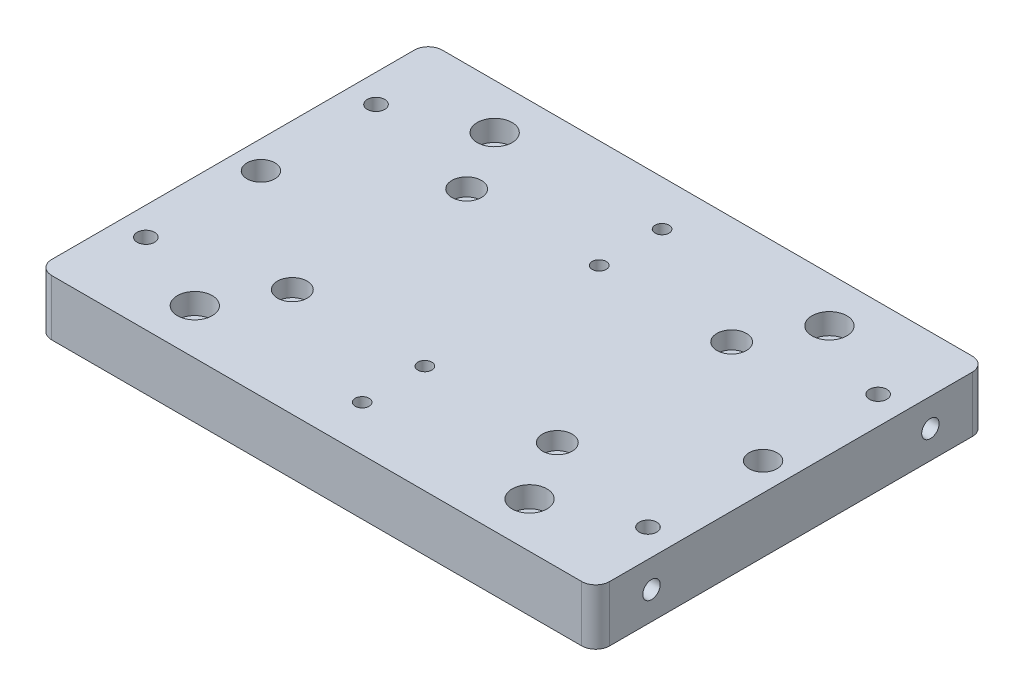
ISO-10303-21;
HEADER;
FILE_DESCRIPTION(('STEP AP214'),'2;1');
FILE_NAME('part.step','',(''),(''),'','','');
FILE_SCHEMA(('AUTOMOTIVE_DESIGN { 1 0 10303 214 1 1 1 1 }'));
ENDSEC;
DATA;
#1=APPLICATION_CONTEXT('core data for automotive mechanical design processes');
#2=APPLICATION_PROTOCOL_DEFINITION('international standard','automotive_design',2000,#1);
#3=PRODUCT_CONTEXT('',#1,'mechanical');
#4=PRODUCT('Part','Part','',(#3));
#5=PRODUCT_RELATED_PRODUCT_CATEGORY('part','',(#4));
#6=PRODUCT_DEFINITION_FORMATION('','',#4);
#7=PRODUCT_DEFINITION_CONTEXT('part definition',#1,'design');
#8=PRODUCT_DEFINITION('design','',#6,#7);
#9=PRODUCT_DEFINITION_SHAPE('','',#8);
#10=(LENGTH_UNIT() NAMED_UNIT(*) SI_UNIT(.MILLI.,.METRE.));
#11=(NAMED_UNIT(*) PLANE_ANGLE_UNIT() SI_UNIT($,.RADIAN.));
#12=(NAMED_UNIT(*) SI_UNIT($,.STERADIAN.) SOLID_ANGLE_UNIT());
#13=UNCERTAINTY_MEASURE_WITH_UNIT(LENGTH_MEASURE(1.E-05),#10,'distance_accuracy_value','');
#14=(GEOMETRIC_REPRESENTATION_CONTEXT(3) GLOBAL_UNCERTAINTY_ASSIGNED_CONTEXT((#13)) GLOBAL_UNIT_ASSIGNED_CONTEXT((#10,
#11,#12)) REPRESENTATION_CONTEXT('',''));
#15=CARTESIAN_POINT('',(0.,0.,0.));
#16=DIRECTION('',(0.,0.,1.));
#17=DIRECTION('',(1.,0.,0.));
#18=AXIS2_PLACEMENT_3D('',#15,#16,#17);
#19=CARTESIAN_POINT('',(0.,25.4,0.));
#20=DIRECTION('',(0.,1.,0.));
#21=DIRECTION('',(0.,0.,1.));
#22=AXIS2_PLACEMENT_3D('',#19,#20,#21);
#23=PLANE('',#22);
#24=CARTESIAN_POINT('',(7.43410938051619E-12,25.4,-68.3259999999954));
#25=DIRECTION('',(0.,-1.,0.));
#26=DIRECTION('',(0.,0.,-1.));
#27=AXIS2_PLACEMENT_3D('',#24,#25,#26);
#28=CIRCLE('',#27,3.17499999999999);
#29=CARTESIAN_POINT('',(7.43410938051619E-12,25.4,-71.5009999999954));
#30=VERTEX_POINT('',#29);
#31=EDGE_CURVE('E151',#30,#30,#28,.T.);
#32=ORIENTED_EDGE('',*,*,#31,.T.);
#33=EDGE_LOOP('',(#32));
#34=FACE_BOUND('',#33,.T.);
#35=DIRECTION('',(0.,0.,1.));
#36=VECTOR('',#35,1.);
#37=CARTESIAN_POINT('',(-127.,25.4,-88.9));
#38=LINE('',#37,#36);
#39=CARTESIAN_POINT('',(-127.,25.4,-82.55));
#40=VERTEX_POINT('',#39);
#41=CARTESIAN_POINT('',(-127.,25.4,82.55));
#42=VERTEX_POINT('',#41);
#43=EDGE_CURVE('E310',#40,#42,#38,.T.);
#44=ORIENTED_EDGE('',*,*,#43,.T.);
#45=CARTESIAN_POINT('',(-120.65,25.4,82.55));
#46=DIRECTION('',(0.,1.,0.));
#47=DIRECTION('',(0.,0.,1.));
#48=AXIS2_PLACEMENT_3D('',#45,#46,#47);
#49=CIRCLE('',#48,6.35);
#50=CARTESIAN_POINT('',(-120.65,25.4,88.9));
#51=VERTEX_POINT('',#50);
#52=EDGE_CURVE('E348',#42,#51,#49,.T.);
#53=ORIENTED_EDGE('',*,*,#52,.T.);
#54=DIRECTION('',(1.,0.,0.));
#55=VECTOR('',#54,1.);
#56=CARTESIAN_POINT('',(-127.,25.4,88.9));
#57=LINE('',#56,#55);
#58=CARTESIAN_POINT('',(120.65,25.4,88.9));
#59=VERTEX_POINT('',#58);
#60=EDGE_CURVE('E313',#51,#59,#57,.T.);
#61=ORIENTED_EDGE('',*,*,#60,.T.);
#62=CARTESIAN_POINT('',(120.65,25.4,82.55));
#63=DIRECTION('',(0.,1.,0.));
#64=DIRECTION('',(0.,0.,1.));
#65=AXIS2_PLACEMENT_3D('',#62,#63,#64);
#66=CIRCLE('',#65,6.35);
#67=CARTESIAN_POINT('',(127.,25.4,82.55));
#68=VERTEX_POINT('',#67);
#69=EDGE_CURVE('E343',#59,#68,#66,.T.);
#70=ORIENTED_EDGE('',*,*,#69,.T.);
#71=DIRECTION('',(0.,0.,-1.));
#72=VECTOR('',#71,1.);
#73=CARTESIAN_POINT('',(127.,25.4,-88.9));
#74=LINE('',#73,#72);
#75=CARTESIAN_POINT('',(127.,25.4,-82.55));
#76=VERTEX_POINT('',#75);
#77=EDGE_CURVE('E305',#68,#76,#74,.T.);
#78=ORIENTED_EDGE('',*,*,#77,.T.);
#79=CARTESIAN_POINT('',(120.65,25.4,-82.55));
#80=DIRECTION('',(0.,1.,0.));
#81=DIRECTION('',(0.,0.,1.));
#82=AXIS2_PLACEMENT_3D('',#79,#80,#81);
#83=CIRCLE('',#82,6.35);
#84=CARTESIAN_POINT('',(120.65,25.4,-88.9));
#85=VERTEX_POINT('',#84);
#86=EDGE_CURVE('E61',#76,#85,#83,.T.);
#87=ORIENTED_EDGE('',*,*,#86,.T.);
#88=DIRECTION('',(-1.,0.,0.));
#89=VECTOR('',#88,1.);
#90=CARTESIAN_POINT('',(-127.,25.4,-88.9));
#91=LINE('',#90,#89);
#92=CARTESIAN_POINT('',(-120.65,25.4,-88.9));
#93=VERTEX_POINT('',#92);
#94=EDGE_CURVE('E307',#85,#93,#91,.T.);
#95=ORIENTED_EDGE('',*,*,#94,.T.);
#96=CARTESIAN_POINT('',(-120.65,25.4,-82.55));
#97=DIRECTION('',(0.,1.,0.));
#98=DIRECTION('',(0.,0.,1.));
#99=AXIS2_PLACEMENT_3D('',#96,#97,#98);
#100=CIRCLE('',#99,6.35);
#101=EDGE_CURVE('E346',#93,#40,#100,.T.);
#102=ORIENTED_EDGE('',*,*,#101,.T.);
#103=EDGE_LOOP('',(#44,#53,#61,#70,#78,#87,#95,#102));
#104=FACE_BOUND('',#103,.T.);
#105=CARTESIAN_POINT('',(-60.325,25.4,39.6875));
#106=DIRECTION('',(0.,1.,0.));
#107=DIRECTION('',(0.,0.,1.));
#108=AXIS2_PLACEMENT_3D('',#105,#106,#107);
#109=CIRCLE('',#108,6.74751);
#110=CARTESIAN_POINT('',(-60.325,25.4,46.43501));
#111=VERTEX_POINT('',#110);
#112=EDGE_CURVE('E292',#111,#111,#109,.T.);
#113=ORIENTED_EDGE('',*,*,#112,.F.);
#114=EDGE_LOOP('',(#113));
#115=FACE_BOUND('',#114,.T.);
#116=CARTESIAN_POINT('',(60.325,25.4,39.6875));
#117=DIRECTION('',(0.,1.,0.));
#118=DIRECTION('',(0.,0.,1.));
#119=AXIS2_PLACEMENT_3D('',#116,#117,#118);
#120=CIRCLE('',#119,6.74751);
#121=CARTESIAN_POINT('',(60.325,25.4,46.43501));
#122=VERTEX_POINT('',#121);
#123=EDGE_CURVE('E280',#122,#122,#120,.T.);
#124=ORIENTED_EDGE('',*,*,#123,.F.);
#125=EDGE_LOOP('',(#124));
#126=FACE_BOUND('',#125,.T.);
#127=CARTESIAN_POINT('',(60.325,25.4,-39.6875));
#128=DIRECTION('',(0.,1.,0.));
#129=DIRECTION('',(0.,0.,1.));
#130=AXIS2_PLACEMENT_3D('',#127,#128,#129);
#131=CIRCLE('',#130,6.74751);
#132=CARTESIAN_POINT('',(60.325,25.4,-32.93999));
#133=VERTEX_POINT('',#132);
#134=EDGE_CURVE('E268',#133,#133,#131,.T.);
#135=ORIENTED_EDGE('',*,*,#134,.F.);
#136=EDGE_LOOP('',(#135));
#137=FACE_BOUND('',#136,.T.);
#138=CARTESIAN_POINT('',(-60.325,25.4,-39.6875));
#139=DIRECTION('',(0.,1.,0.));
#140=DIRECTION('',(0.,0.,1.));
#141=AXIS2_PLACEMENT_3D('',#138,#139,#140);
#142=CIRCLE('',#141,6.74751);
#143=CARTESIAN_POINT('',(-60.325,25.4,-32.93999));
#144=VERTEX_POINT('',#143);
#145=EDGE_CURVE('E256',#144,#144,#142,.T.);
#146=ORIENTED_EDGE('',*,*,#145,.F.);
#147=EDGE_LOOP('',(#146));
#148=FACE_BOUND('',#147,.T.);
#149=CARTESIAN_POINT('',(0.,25.4,-39.7002));
#150=DIRECTION('',(0.,1.,0.));
#151=DIRECTION('',(0.,0.,1.));
#152=AXIS2_PLACEMENT_3D('',#149,#150,#151);
#153=CIRCLE('',#152,3.175);
#154=CARTESIAN_POINT('',(0.,25.4,-36.5252));
#155=VERTEX_POINT('',#154);
#156=EDGE_CURVE('E250',#155,#155,#153,.T.);
#157=ORIENTED_EDGE('',*,*,#156,.F.);
#158=EDGE_LOOP('',(#157));
#159=FACE_BOUND('',#158,.T.);
#160=CARTESIAN_POINT('',(0.,25.4,39.6748));
#161=DIRECTION('',(0.,1.,0.));
#162=DIRECTION('',(0.,0.,1.));
#163=AXIS2_PLACEMENT_3D('',#160,#161,#162);
#164=CIRCLE('',#163,3.175);
#165=CARTESIAN_POINT('',(0.,25.4,42.8498));
#166=VERTEX_POINT('',#165);
#167=EDGE_CURVE('E244',#166,#166,#164,.T.);
#168=ORIENTED_EDGE('',*,*,#167,.F.);
#169=EDGE_LOOP('',(#168));
#170=FACE_BOUND('',#169,.T.);
#171=CARTESIAN_POINT('',(114.300000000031,25.4,-52.3875000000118));
#172=DIRECTION('',(0.,1.,0.));
#173=DIRECTION('',(0.,0.,1.));
#174=AXIS2_PLACEMENT_3D('',#171,#172,#173);
#175=CIRCLE('',#174,3.96874999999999);
#176=CARTESIAN_POINT('',(114.300000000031,25.4,-48.4187500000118));
#177=VERTEX_POINT('',#176);
#178=EDGE_CURVE('E238',#177,#177,#175,.T.);
#179=ORIENTED_EDGE('',*,*,#178,.F.);
#180=EDGE_LOOP('',(#179));
#181=FACE_BOUND('',#180,.T.);
#182=CARTESIAN_POINT('',(114.300000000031,25.4,52.387499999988));
#183=DIRECTION('',(0.,1.,0.));
#184=DIRECTION('',(0.,0.,1.));
#185=AXIS2_PLACEMENT_3D('',#182,#183,#184);
#186=CIRCLE('',#185,3.96874999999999);
#187=CARTESIAN_POINT('',(114.300000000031,25.4,56.356249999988));
#188=VERTEX_POINT('',#187);
#189=EDGE_CURVE('E232',#188,#188,#186,.T.);
#190=ORIENTED_EDGE('',*,*,#189,.F.);
#191=EDGE_LOOP('',(#190));
#192=FACE_BOUND('',#191,.T.);
#193=CARTESIAN_POINT('',(-114.299999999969,25.4,52.387499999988));
#194=DIRECTION('',(0.,1.,0.));
#195=DIRECTION('',(0.,0.,1.));
#196=AXIS2_PLACEMENT_3D('',#193,#194,#195);
#197=CIRCLE('',#196,3.96874999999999);
#198=CARTESIAN_POINT('',(-114.299999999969,25.4,56.356249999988));
#199=VERTEX_POINT('',#198);
#200=EDGE_CURVE('E226',#199,#199,#197,.T.);
#201=ORIENTED_EDGE('',*,*,#200,.F.);
#202=EDGE_LOOP('',(#201));
#203=FACE_BOUND('',#202,.T.);
#204=CARTESIAN_POINT('',(-114.299999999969,25.4,-52.3875000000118));
#205=DIRECTION('',(0.,1.,0.));
#206=DIRECTION('',(0.,0.,1.));
#207=AXIS2_PLACEMENT_3D('',#204,#205,#206);
#208=CIRCLE('',#207,3.96874999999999);
#209=CARTESIAN_POINT('',(-114.299999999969,25.4,-48.4187500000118));
#210=VERTEX_POINT('',#209);
#211=EDGE_CURVE('E220',#210,#210,#208,.T.);
#212=ORIENTED_EDGE('',*,*,#211,.F.);
#213=EDGE_LOOP('',(#212));
#214=FACE_BOUND('',#213,.T.);
#215=CARTESIAN_POINT('',(114.300000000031,25.4,-1.19904086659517E-11));
#216=DIRECTION('',(0.,1.,0.));
#217=DIRECTION('',(0.,0.,1.));
#218=AXIS2_PLACEMENT_3D('',#215,#216,#217);
#219=CIRCLE('',#218,6.34999999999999);
#220=CARTESIAN_POINT('',(114.300000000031,25.4,6.349999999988));
#221=VERTEX_POINT('',#220);
#222=EDGE_CURVE('E214',#221,#221,#219,.T.);
#223=ORIENTED_EDGE('',*,*,#222,.F.);
#224=EDGE_LOOP('',(#223));
#225=FACE_BOUND('',#224,.T.);
#226=CARTESIAN_POINT('',(-114.299999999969,25.4,-1.19904086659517E-11));
#227=DIRECTION('',(0.,1.,0.));
#228=DIRECTION('',(0.,0.,1.));
#229=AXIS2_PLACEMENT_3D('',#226,#227,#228);
#230=CIRCLE('',#229,6.34999999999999);
#231=CARTESIAN_POINT('',(-114.299999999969,25.4,6.349999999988));
#232=VERTEX_POINT('',#231);
#233=EDGE_CURVE('E208',#232,#232,#230,.T.);
#234=ORIENTED_EDGE('',*,*,#233,.F.);
#235=EDGE_LOOP('',(#234));
#236=FACE_BOUND('',#235,.T.);
#237=CARTESIAN_POINT('',(76.2000000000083,25.4,68.2117000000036));
#238=DIRECTION('',(0.,1.,0.));
#239=DIRECTION('',(0.,0.,1.));
#240=AXIS2_PLACEMENT_3D('',#237,#238,#239);
#241=CIRCLE('',#240,7.9375);
#242=CARTESIAN_POINT('',(76.2000000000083,25.4,76.1492000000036));
#243=VERTEX_POINT('',#242);
#244=EDGE_CURVE('E196',#243,#243,#241,.T.);
#245=ORIENTED_EDGE('',*,*,#244,.F.);
#246=EDGE_LOOP('',(#245));
#247=FACE_BOUND('',#246,.T.);
#248=CARTESIAN_POINT('',(-76.1999999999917,25.4,68.2117000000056));
#249=DIRECTION('',(0.,1.,0.));
#250=DIRECTION('',(0.,0.,1.));
#251=AXIS2_PLACEMENT_3D('',#248,#249,#250);
#252=CIRCLE('',#251,7.9375);
#253=CARTESIAN_POINT('',(-76.1999999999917,25.4,76.1492000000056));
#254=VERTEX_POINT('',#253);
#255=EDGE_CURVE('E184',#254,#254,#252,.T.);
#256=ORIENTED_EDGE('',*,*,#255,.F.);
#257=EDGE_LOOP('',(#256));
#258=FACE_BOUND('',#257,.T.);
#259=CARTESIAN_POINT('',(-76.1999999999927,25.4,-68.3132999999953));
#260=DIRECTION('',(0.,1.,0.));
#261=DIRECTION('',(0.,0.,1.));
#262=AXIS2_PLACEMENT_3D('',#259,#260,#261);
#263=CIRCLE('',#262,7.9375);
#264=CARTESIAN_POINT('',(-76.1999999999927,25.4,-60.3757999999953));
#265=VERTEX_POINT('',#264);
#266=EDGE_CURVE('E172',#265,#265,#263,.T.);
#267=ORIENTED_EDGE('',*,*,#266,.F.);
#268=EDGE_LOOP('',(#267));
#269=FACE_BOUND('',#268,.T.);
#270=CARTESIAN_POINT('',(76.2000000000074,25.4,-68.3132999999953));
#271=DIRECTION('',(0.,1.,0.));
#272=DIRECTION('',(0.,0.,1.));
#273=AXIS2_PLACEMENT_3D('',#270,#271,#272);
#274=CIRCLE('',#273,7.9375);
#275=CARTESIAN_POINT('',(76.2000000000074,25.4,-60.3757999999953));
#276=VERTEX_POINT('',#275);
#277=EDGE_CURVE('E160',#276,#276,#274,.T.);
#278=ORIENTED_EDGE('',*,*,#277,.F.);
#279=EDGE_LOOP('',(#278));
#280=FACE_BOUND('',#279,.T.);
#281=CARTESIAN_POINT('',(9.18141225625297E-12,25.4,68.1990000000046));
#282=DIRECTION('',(0.,-1.,0.));
#283=DIRECTION('',(0.,0.,-1.));
#284=AXIS2_PLACEMENT_3D('',#281,#282,#283);
#285=CIRCLE('',#284,3.17499999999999);
#286=CARTESIAN_POINT('',(9.18141225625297E-12,25.4,65.0240000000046));
#287=VERTEX_POINT('',#286);
#288=EDGE_CURVE('E157',#287,#287,#285,.T.);
#289=ORIENTED_EDGE('',*,*,#288,.T.);
#290=EDGE_LOOP('',(#289));
#291=FACE_BOUND('',#290,.T.);
#292=ADVANCED_FACE('F39',(#34,#104,#115,#126,#137,#148,#159,#170,#181,#192,#203,#214,#225,#236,
#247,#258,#269,#280,#291),#23,.T.);
#293=CARTESIAN_POINT('',(127.,25.4,-88.9));
#294=DIRECTION('',(-1.,0.,0.));
#295=DIRECTION('',(0.,0.,1.));
#296=AXIS2_PLACEMENT_3D('',#293,#294,#295);
#297=PLANE('',#296);
#298=CARTESIAN_POINT('',(127.,12.7,63.5));
#299=DIRECTION('',(1.,0.,0.));
#300=DIRECTION('',(0.,0.,-1.));
#301=AXIS2_PLACEMENT_3D('',#298,#299,#300);
#302=CIRCLE('',#301,3.96875);
#303=CARTESIAN_POINT('',(127.,12.7,59.53125));
#304=VERTEX_POINT('',#303);
#305=EDGE_CURVE('E126',#304,#304,#302,.T.);
#306=ORIENTED_EDGE('',*,*,#305,.F.);
#307=EDGE_LOOP('',(#306));
#308=FACE_BOUND('',#307,.T.);
#309=CARTESIAN_POINT('',(127.,12.7,-63.5));
#310=DIRECTION('',(1.,0.,0.));
#311=DIRECTION('',(0.,0.,-1.));
#312=AXIS2_PLACEMENT_3D('',#309,#310,#311);
#313=CIRCLE('',#312,3.96875);
#314=CARTESIAN_POINT('',(127.,12.7,-67.46875));
#315=VERTEX_POINT('',#314);
#316=EDGE_CURVE('E125',#315,#315,#313,.T.);
#317=ORIENTED_EDGE('',*,*,#316,.F.);
#318=EDGE_LOOP('',(#317));
#319=FACE_BOUND('',#318,.T.);
#320=DIRECTION('',(0.,0.,-1.));
#321=VECTOR('',#320,1.);
#322=CARTESIAN_POINT('',(127.,0.,-88.9));
#323=LINE('',#322,#321);
#324=CARTESIAN_POINT('',(127.,0.,82.55));
#325=VERTEX_POINT('',#324);
#326=CARTESIAN_POINT('',(127.,0.,-82.55));
#327=VERTEX_POINT('',#326);
#328=EDGE_CURVE('E304',#325,#327,#323,.T.);
#329=ORIENTED_EDGE('',*,*,#328,.T.);
#330=DIRECTION('',(0.,-1.,0.));
#331=VECTOR('',#330,1.);
#332=CARTESIAN_POINT('',(127.,25.4,-82.55));
#333=LINE('',#332,#331);
#334=EDGE_CURVE('E11',#327,#76,#333,.F.);
#335=ORIENTED_EDGE('',*,*,#334,.T.);
#336=ORIENTED_EDGE('',*,*,#77,.F.);
#337=DIRECTION('',(0.,-1.,0.));
#338=VECTOR('',#337,1.);
#339=CARTESIAN_POINT('',(127.,25.4,82.55));
#340=LINE('',#339,#338);
#341=EDGE_CURVE('E47',#68,#325,#340,.T.);
#342=ORIENTED_EDGE('',*,*,#341,.T.);
#343=EDGE_LOOP('',(#329,#335,#336,#342));
#344=FACE_BOUND('',#343,.T.);
#345=ADVANCED_FACE('F358',(#308,#319,#344),#297,.F.);
#346=CARTESIAN_POINT('',(-127.,25.4,-88.9));
#347=DIRECTION('',(0.,0.,1.));
#348=DIRECTION('',(1.,0.,0.));
#349=AXIS2_PLACEMENT_3D('',#346,#347,#348);
#350=PLANE('',#349);
#351=DIRECTION('',(-1.,0.,0.));
#352=VECTOR('',#351,1.);
#353=CARTESIAN_POINT('',(-127.,0.,-88.9));
#354=LINE('',#353,#352);
#355=CARTESIAN_POINT('',(120.65,0.,-88.9));
#356=VERTEX_POINT('',#355);
#357=CARTESIAN_POINT('',(-120.65,0.,-88.9));
#358=VERTEX_POINT('',#357);
#359=EDGE_CURVE('E319',#356,#358,#354,.T.);
#360=ORIENTED_EDGE('',*,*,#359,.T.);
#361=DIRECTION('',(0.,-1.,0.));
#362=VECTOR('',#361,1.);
#363=CARTESIAN_POINT('',(-120.65,25.4,-88.9));
#364=LINE('',#363,#362);
#365=EDGE_CURVE('E54',#358,#93,#364,.F.);
#366=ORIENTED_EDGE('',*,*,#365,.T.);
#367=ORIENTED_EDGE('',*,*,#94,.F.);
#368=DIRECTION('',(0.,-1.,0.));
#369=VECTOR('',#368,1.);
#370=CARTESIAN_POINT('',(120.65,25.4,-88.9));
#371=LINE('',#370,#369);
#372=EDGE_CURVE('E350',#85,#356,#371,.T.);
#373=ORIENTED_EDGE('',*,*,#372,.T.);
#374=EDGE_LOOP('',(#360,#366,#367,#373));
#375=FACE_BOUND('',#374,.T.);
#376=ADVANCED_FACE('F369',(#375),#350,.F.);
#377=CARTESIAN_POINT('',(-127.,25.4,-88.9));
#378=DIRECTION('',(1.,0.,0.));
#379=DIRECTION('',(0.,0.,-1.));
#380=AXIS2_PLACEMENT_3D('',#377,#378,#379);
#381=PLANE('',#380);
#382=CARTESIAN_POINT('',(-127.,12.7,63.5));
#383=DIRECTION('',(-1.,0.,0.));
#384=DIRECTION('',(0.,0.,1.));
#385=AXIS2_PLACEMENT_3D('',#382,#383,#384);
#386=CIRCLE('',#385,3.96875);
#387=CARTESIAN_POINT('',(-127.,12.7,67.46875));
#388=VERTEX_POINT('',#387);
#389=EDGE_CURVE('E136',#388,#388,#386,.T.);
#390=ORIENTED_EDGE('',*,*,#389,.F.);
#391=EDGE_LOOP('',(#390));
#392=FACE_BOUND('',#391,.T.);
#393=CARTESIAN_POINT('',(-127.,12.7,-63.5));
#394=DIRECTION('',(-1.,0.,0.));
#395=DIRECTION('',(0.,0.,1.));
#396=AXIS2_PLACEMENT_3D('',#393,#394,#395);
#397=CIRCLE('',#396,3.96875);
#398=CARTESIAN_POINT('',(-127.,12.7,-59.53125));
#399=VERTEX_POINT('',#398);
#400=EDGE_CURVE('E142',#399,#399,#397,.T.);
#401=ORIENTED_EDGE('',*,*,#400,.F.);
#402=EDGE_LOOP('',(#401));
#403=FACE_BOUND('',#402,.T.);
#404=DIRECTION('',(0.,0.,1.));
#405=VECTOR('',#404,1.);
#406=CARTESIAN_POINT('',(-127.,0.,-88.9));
#407=LINE('',#406,#405);
#408=CARTESIAN_POINT('',(-127.,0.,-82.55));
#409=VERTEX_POINT('',#408);
#410=CARTESIAN_POINT('',(-127.,0.,82.55));
#411=VERTEX_POINT('',#410);
#412=EDGE_CURVE('E321',#409,#411,#407,.T.);
#413=ORIENTED_EDGE('',*,*,#412,.T.);
#414=DIRECTION('',(0.,-1.,0.));
#415=VECTOR('',#414,1.);
#416=CARTESIAN_POINT('',(-127.,25.4,82.55));
#417=LINE('',#416,#415);
#418=EDGE_CURVE('E341',#411,#42,#417,.F.);
#419=ORIENTED_EDGE('',*,*,#418,.T.);
#420=ORIENTED_EDGE('',*,*,#43,.F.);
#421=DIRECTION('',(0.,-1.,0.));
#422=VECTOR('',#421,1.);
#423=CARTESIAN_POINT('',(-127.,25.4,-82.55));
#424=LINE('',#423,#422);
#425=EDGE_CURVE('E338',#40,#409,#424,.T.);
#426=ORIENTED_EDGE('',*,*,#425,.T.);
#427=EDGE_LOOP('',(#413,#419,#420,#426));
#428=FACE_BOUND('',#427,.T.);
#429=ADVANCED_FACE('F378',(#392,#403,#428),#381,.F.);
#430=CARTESIAN_POINT('',(-127.,25.4,88.9));
#431=DIRECTION('',(0.,0.,-1.));
#432=DIRECTION('',(-1.,0.,0.));
#433=AXIS2_PLACEMENT_3D('',#430,#431,#432);
#434=PLANE('',#433);
#435=ORIENTED_EDGE('',*,*,#60,.F.);
#436=DIRECTION('',(0.,-1.,0.));
#437=VECTOR('',#436,1.);
#438=CARTESIAN_POINT('',(-120.65,25.4,88.9));
#439=LINE('',#438,#437);
#440=CARTESIAN_POINT('',(-120.65,0.,88.9));
#441=VERTEX_POINT('',#440);
#442=EDGE_CURVE('E327',#51,#441,#439,.T.);
#443=ORIENTED_EDGE('',*,*,#442,.T.);
#444=DIRECTION('',(1.,0.,0.));
#445=VECTOR('',#444,1.);
#446=CARTESIAN_POINT('',(-127.,0.,88.9));
#447=LINE('',#446,#445);
#448=CARTESIAN_POINT('',(120.65,0.,88.9));
#449=VERTEX_POINT('',#448);
#450=EDGE_CURVE('E308',#441,#449,#447,.T.);
#451=ORIENTED_EDGE('',*,*,#450,.T.);
#452=DIRECTION('',(0.,-1.,0.));
#453=VECTOR('',#452,1.);
#454=CARTESIAN_POINT('',(120.65,25.4,88.9));
#455=LINE('',#454,#453);
#456=EDGE_CURVE('E316',#449,#59,#455,.F.);
#457=ORIENTED_EDGE('',*,*,#456,.T.);
#458=EDGE_LOOP('',(#435,#443,#451,#457));
#459=FACE_BOUND('',#458,.T.);
#460=ADVANCED_FACE('F386',(#459),#434,.F.);
#461=CARTESIAN_POINT('',(0.,0.,0.));
#462=DIRECTION('',(0.,1.,0.));
#463=DIRECTION('',(0.,0.,1.));
#464=AXIS2_PLACEMENT_3D('',#461,#462,#463);
#465=PLANE('',#464);
#466=CARTESIAN_POINT('',(7.43410938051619E-12,0.,-68.3259999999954));
#467=DIRECTION('',(0.,-1.,0.));
#468=DIRECTION('',(0.,0.,-1.));
#469=AXIS2_PLACEMENT_3D('',#466,#467,#468);
#470=CIRCLE('',#469,3.175);
#471=CARTESIAN_POINT('',(7.43410938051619E-12,0.,-71.5009999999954));
#472=VERTEX_POINT('',#471);
#473=EDGE_CURVE('E148',#472,#472,#470,.T.);
#474=ORIENTED_EDGE('',*,*,#473,.F.);
#475=EDGE_LOOP('',(#474));
#476=FACE_BOUND('',#475,.T.);
#477=CARTESIAN_POINT('',(9.18141225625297E-12,0.,68.1990000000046));
#478=DIRECTION('',(0.,-1.,0.));
#479=DIRECTION('',(0.,0.,-1.));
#480=AXIS2_PLACEMENT_3D('',#477,#478,#479);
#481=CIRCLE('',#480,3.175);
#482=CARTESIAN_POINT('',(9.18141225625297E-12,0.,65.0240000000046));
#483=VERTEX_POINT('',#482);
#484=EDGE_CURVE('E154',#483,#483,#481,.T.);
#485=ORIENTED_EDGE('',*,*,#484,.F.);
#486=EDGE_LOOP('',(#485));
#487=FACE_BOUND('',#486,.T.);
#488=CARTESIAN_POINT('',(76.2000000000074,0.,-68.3132999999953));
#489=DIRECTION('',(0.,1.,0.));
#490=DIRECTION('',(0.,0.,1.));
#491=AXIS2_PLACEMENT_3D('',#488,#489,#490);
#492=CIRCLE('',#491,5.04189999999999);
#493=CARTESIAN_POINT('',(76.2000000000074,0.,-63.2713999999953));
#494=VERTEX_POINT('',#493);
#495=EDGE_CURVE('E169',#494,#494,#492,.T.);
#496=ORIENTED_EDGE('',*,*,#495,.T.);
#497=EDGE_LOOP('',(#496));
#498=FACE_BOUND('',#497,.T.);
#499=CARTESIAN_POINT('',(-76.1999999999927,0.,-68.3132999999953));
#500=DIRECTION('',(0.,1.,0.));
#501=DIRECTION('',(0.,0.,1.));
#502=AXIS2_PLACEMENT_3D('',#499,#500,#501);
#503=CIRCLE('',#502,5.04189999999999);
#504=CARTESIAN_POINT('',(-76.1999999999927,0.,-63.2713999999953));
#505=VERTEX_POINT('',#504);
#506=EDGE_CURVE('E181',#505,#505,#503,.T.);
#507=ORIENTED_EDGE('',*,*,#506,.T.);
#508=EDGE_LOOP('',(#507));
#509=FACE_BOUND('',#508,.T.);
#510=CARTESIAN_POINT('',(-76.1999999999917,0.,68.2117000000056));
#511=DIRECTION('',(0.,1.,0.));
#512=DIRECTION('',(0.,0.,1.));
#513=AXIS2_PLACEMENT_3D('',#510,#511,#512);
#514=CIRCLE('',#513,5.04189999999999);
#515=CARTESIAN_POINT('',(-76.1999999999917,0.,73.2536000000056));
#516=VERTEX_POINT('',#515);
#517=EDGE_CURVE('E193',#516,#516,#514,.T.);
#518=ORIENTED_EDGE('',*,*,#517,.T.);
#519=EDGE_LOOP('',(#518));
#520=FACE_BOUND('',#519,.T.);
#521=CARTESIAN_POINT('',(76.2000000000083,0.,68.2117000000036));
#522=DIRECTION('',(0.,1.,0.));
#523=DIRECTION('',(0.,0.,1.));
#524=AXIS2_PLACEMENT_3D('',#521,#522,#523);
#525=CIRCLE('',#524,5.04189999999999);
#526=CARTESIAN_POINT('',(76.2000000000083,0.,73.2536000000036));
#527=VERTEX_POINT('',#526);
#528=EDGE_CURVE('E205',#527,#527,#525,.T.);
#529=ORIENTED_EDGE('',*,*,#528,.T.);
#530=EDGE_LOOP('',(#529));
#531=FACE_BOUND('',#530,.T.);
#532=CARTESIAN_POINT('',(-114.299999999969,0.,-1.19904086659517E-11));
#533=DIRECTION('',(0.,1.,0.));
#534=DIRECTION('',(0.,0.,1.));
#535=AXIS2_PLACEMENT_3D('',#532,#533,#534);
#536=CIRCLE('',#535,6.34999999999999);
#537=CARTESIAN_POINT('',(-114.299999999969,0.,6.349999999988));
#538=VERTEX_POINT('',#537);
#539=EDGE_CURVE('E211',#538,#538,#536,.T.);
#540=ORIENTED_EDGE('',*,*,#539,.T.);
#541=EDGE_LOOP('',(#540));
#542=FACE_BOUND('',#541,.T.);
#543=CARTESIAN_POINT('',(114.300000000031,0.,-1.19904086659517E-11));
#544=DIRECTION('',(0.,1.,0.));
#545=DIRECTION('',(0.,0.,1.));
#546=AXIS2_PLACEMENT_3D('',#543,#544,#545);
#547=CIRCLE('',#546,6.34999999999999);
#548=CARTESIAN_POINT('',(114.300000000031,0.,6.349999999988));
#549=VERTEX_POINT('',#548);
#550=EDGE_CURVE('E217',#549,#549,#547,.T.);
#551=ORIENTED_EDGE('',*,*,#550,.T.);
#552=EDGE_LOOP('',(#551));
#553=FACE_BOUND('',#552,.T.);
#554=CARTESIAN_POINT('',(-114.299999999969,0.,-52.3875000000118));
#555=DIRECTION('',(0.,1.,0.));
#556=DIRECTION('',(0.,0.,1.));
#557=AXIS2_PLACEMENT_3D('',#554,#555,#556);
#558=CIRCLE('',#557,3.96874999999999);
#559=CARTESIAN_POINT('',(-114.299999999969,0.,-48.4187500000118));
#560=VERTEX_POINT('',#559);
#561=EDGE_CURVE('E223',#560,#560,#558,.T.);
#562=ORIENTED_EDGE('',*,*,#561,.T.);
#563=EDGE_LOOP('',(#562));
#564=FACE_BOUND('',#563,.T.);
#565=CARTESIAN_POINT('',(-114.299999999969,0.,52.387499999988));
#566=DIRECTION('',(0.,1.,0.));
#567=DIRECTION('',(0.,0.,1.));
#568=AXIS2_PLACEMENT_3D('',#565,#566,#567);
#569=CIRCLE('',#568,3.96874999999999);
#570=CARTESIAN_POINT('',(-114.299999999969,0.,56.356249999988));
#571=VERTEX_POINT('',#570);
#572=EDGE_CURVE('E229',#571,#571,#569,.T.);
#573=ORIENTED_EDGE('',*,*,#572,.T.);
#574=EDGE_LOOP('',(#573));
#575=FACE_BOUND('',#574,.T.);
#576=CARTESIAN_POINT('',(114.300000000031,0.,52.387499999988));
#577=DIRECTION('',(0.,1.,0.));
#578=DIRECTION('',(0.,0.,1.));
#579=AXIS2_PLACEMENT_3D('',#576,#577,#578);
#580=CIRCLE('',#579,3.96874999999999);
#581=CARTESIAN_POINT('',(114.300000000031,0.,56.356249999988));
#582=VERTEX_POINT('',#581);
#583=EDGE_CURVE('E235',#582,#582,#580,.T.);
#584=ORIENTED_EDGE('',*,*,#583,.T.);
#585=EDGE_LOOP('',(#584));
#586=FACE_BOUND('',#585,.T.);
#587=CARTESIAN_POINT('',(114.300000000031,0.,-52.3875000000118));
#588=DIRECTION('',(0.,1.,0.));
#589=DIRECTION('',(0.,0.,1.));
#590=AXIS2_PLACEMENT_3D('',#587,#588,#589);
#591=CIRCLE('',#590,3.96874999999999);
#592=CARTESIAN_POINT('',(114.300000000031,0.,-48.4187500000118));
#593=VERTEX_POINT('',#592);
#594=EDGE_CURVE('E241',#593,#593,#591,.T.);
#595=ORIENTED_EDGE('',*,*,#594,.T.);
#596=EDGE_LOOP('',(#595));
#597=FACE_BOUND('',#596,.T.);
#598=CARTESIAN_POINT('',(0.,0.,39.6748));
#599=DIRECTION('',(0.,1.,0.));
#600=DIRECTION('',(0.,0.,1.));
#601=AXIS2_PLACEMENT_3D('',#598,#599,#600);
#602=CIRCLE('',#601,3.17499999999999);
#603=CARTESIAN_POINT('',(0.,0.,42.8498));
#604=VERTEX_POINT('',#603);
#605=EDGE_CURVE('E247',#604,#604,#602,.T.);
#606=ORIENTED_EDGE('',*,*,#605,.T.);
#607=EDGE_LOOP('',(#606));
#608=FACE_BOUND('',#607,.T.);
#609=CARTESIAN_POINT('',(0.,0.,-39.7002));
#610=DIRECTION('',(0.,1.,0.));
#611=DIRECTION('',(0.,0.,1.));
#612=AXIS2_PLACEMENT_3D('',#609,#610,#611);
#613=CIRCLE('',#612,3.17499999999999);
#614=CARTESIAN_POINT('',(0.,0.,-36.5252));
#615=VERTEX_POINT('',#614);
#616=EDGE_CURVE('E253',#615,#615,#613,.T.);
#617=ORIENTED_EDGE('',*,*,#616,.T.);
#618=EDGE_LOOP('',(#617));
#619=FACE_BOUND('',#618,.T.);
#620=CARTESIAN_POINT('',(-60.325,0.,-39.6875));
#621=DIRECTION('',(0.,1.,0.));
#622=DIRECTION('',(0.,0.,1.));
#623=AXIS2_PLACEMENT_3D('',#620,#621,#622);
#624=CIRCLE('',#623,4.21639999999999);
#625=CARTESIAN_POINT('',(-60.325,0.,-35.4711));
#626=VERTEX_POINT('',#625);
#627=EDGE_CURVE('E265',#626,#626,#624,.T.);
#628=ORIENTED_EDGE('',*,*,#627,.T.);
#629=EDGE_LOOP('',(#628));
#630=FACE_BOUND('',#629,.T.);
#631=CARTESIAN_POINT('',(60.325,0.,-39.6875));
#632=DIRECTION('',(0.,1.,0.));
#633=DIRECTION('',(0.,0.,1.));
#634=AXIS2_PLACEMENT_3D('',#631,#632,#633);
#635=CIRCLE('',#634,4.21639999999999);
#636=CARTESIAN_POINT('',(60.325,0.,-35.4711));
#637=VERTEX_POINT('',#636);
#638=EDGE_CURVE('E277',#637,#637,#635,.T.);
#639=ORIENTED_EDGE('',*,*,#638,.T.);
#640=EDGE_LOOP('',(#639));
#641=FACE_BOUND('',#640,.T.);
#642=CARTESIAN_POINT('',(60.325,0.,39.6875));
#643=DIRECTION('',(0.,1.,0.));
#644=DIRECTION('',(0.,0.,1.));
#645=AXIS2_PLACEMENT_3D('',#642,#643,#644);
#646=CIRCLE('',#645,4.21639999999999);
#647=CARTESIAN_POINT('',(60.325,0.,43.9039));
#648=VERTEX_POINT('',#647);
#649=EDGE_CURVE('E289',#648,#648,#646,.T.);
#650=ORIENTED_EDGE('',*,*,#649,.T.);
#651=EDGE_LOOP('',(#650));
#652=FACE_BOUND('',#651,.T.);
#653=CARTESIAN_POINT('',(-60.325,0.,39.6875));
#654=DIRECTION('',(0.,1.,0.));
#655=DIRECTION('',(0.,0.,1.));
#656=AXIS2_PLACEMENT_3D('',#653,#654,#655);
#657=CIRCLE('',#656,4.21639999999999);
#658=CARTESIAN_POINT('',(-60.325,0.,43.9039));
#659=VERTEX_POINT('',#658);
#660=EDGE_CURVE('E301',#659,#659,#657,.T.);
#661=ORIENTED_EDGE('',*,*,#660,.T.);
#662=EDGE_LOOP('',(#661));
#663=FACE_BOUND('',#662,.T.);
#664=ORIENTED_EDGE('',*,*,#450,.F.);
#665=CARTESIAN_POINT('',(-120.65,0.,82.55));
#666=DIRECTION('',(0.,1.,0.));
#667=DIRECTION('',(0.,0.,1.));
#668=AXIS2_PLACEMENT_3D('',#665,#666,#667);
#669=CIRCLE('',#668,6.35);
#670=EDGE_CURVE('E336',#441,#411,#669,.F.);
#671=ORIENTED_EDGE('',*,*,#670,.T.);
#672=ORIENTED_EDGE('',*,*,#412,.F.);
#673=CARTESIAN_POINT('',(-120.65,0.,-82.55));
#674=DIRECTION('',(0.,1.,0.));
#675=DIRECTION('',(0.,0.,1.));
#676=AXIS2_PLACEMENT_3D('',#673,#674,#675);
#677=CIRCLE('',#676,6.35);
#678=EDGE_CURVE('E334',#409,#358,#677,.F.);
#679=ORIENTED_EDGE('',*,*,#678,.T.);
#680=ORIENTED_EDGE('',*,*,#359,.F.);
#681=CARTESIAN_POINT('',(120.65,0.,-82.55));
#682=DIRECTION('',(0.,1.,0.));
#683=DIRECTION('',(0.,0.,1.));
#684=AXIS2_PLACEMENT_3D('',#681,#682,#683);
#685=CIRCLE('',#684,6.35);
#686=EDGE_CURVE('E332',#356,#327,#685,.F.);
#687=ORIENTED_EDGE('',*,*,#686,.T.);
#688=ORIENTED_EDGE('',*,*,#328,.F.);
#689=CARTESIAN_POINT('',(120.65,0.,82.55));
#690=DIRECTION('',(0.,1.,0.));
#691=DIRECTION('',(0.,0.,1.));
#692=AXIS2_PLACEMENT_3D('',#689,#690,#691);
#693=CIRCLE('',#692,6.35);
#694=EDGE_CURVE('E330',#325,#449,#693,.F.);
#695=ORIENTED_EDGE('',*,*,#694,.T.);
#696=EDGE_LOOP('',(#664,#671,#672,#679,#680,#687,#688,#695));
#697=FACE_BOUND('',#696,.T.);
#698=ADVANCED_FACE('F364',(#476,#487,#498,#509,#520,#531,#542,#553,#564,#575,#586,#597,#608,
#619,#630,#641,#652,#663,#697),#465,.F.);
#699=CARTESIAN_POINT('',(-60.325,25.4,39.6875));
#700=DIRECTION('',(0.,1.,0.));
#701=DIRECTION('',(0.,0.,1.));
#702=AXIS2_PLACEMENT_3D('',#699,#700,#701);
#703=CYLINDRICAL_SURFACE('',#702,4.2164);
#704=ORIENTED_EDGE('',*,*,#660,.F.);
#705=EDGE_LOOP('',(#704));
#706=FACE_BOUND('',#705,.T.);
#707=CARTESIAN_POINT('',(-60.325,17.4625,39.6875));
#708=DIRECTION('',(0.,1.,0.));
#709=DIRECTION('',(0.,0.,1.));
#710=AXIS2_PLACEMENT_3D('',#707,#708,#709);
#711=CIRCLE('',#710,4.2164);
#712=CARTESIAN_POINT('',(-60.325,17.4625,43.9039));
#713=VERTEX_POINT('',#712);
#714=EDGE_CURVE('E298',#713,#713,#711,.T.);
#715=ORIENTED_EDGE('',*,*,#714,.T.);
#716=EDGE_LOOP('',(#715));
#717=FACE_BOUND('',#716,.T.);
#718=ADVANCED_FACE('F406',(#706,#717),#703,.F.);
#719=CARTESIAN_POINT('',(-56.1086,17.4625,39.6875));
#720=DIRECTION('',(0.,-1.,0.));
#721=DIRECTION('',(0.,0.,-1.));
#722=AXIS2_PLACEMENT_3D('',#719,#720,#721);
#723=PLANE('',#722);
#724=ORIENTED_EDGE('',*,*,#714,.F.);
#725=EDGE_LOOP('',(#724));
#726=FACE_BOUND('',#725,.T.);
#727=CARTESIAN_POINT('',(-60.325,17.4625,39.6875));
#728=DIRECTION('',(0.,1.,0.));
#729=DIRECTION('',(0.,0.,1.));
#730=AXIS2_PLACEMENT_3D('',#727,#728,#729);
#731=CIRCLE('',#730,6.74751);
#732=CARTESIAN_POINT('',(-60.325,17.4625,46.43501));
#733=VERTEX_POINT('',#732);
#734=EDGE_CURVE('E295',#733,#733,#731,.T.);
#735=ORIENTED_EDGE('',*,*,#734,.T.);
#736=EDGE_LOOP('',(#735));
#737=FACE_BOUND('',#736,.T.);
#738=ADVANCED_FACE('F873',(#726,#737),#723,.F.);
#739=CARTESIAN_POINT('',(-60.325,25.4,39.6875));
#740=DIRECTION('',(0.,1.,0.));
#741=DIRECTION('',(0.,0.,1.));
#742=AXIS2_PLACEMENT_3D('',#739,#740,#741);
#743=CYLINDRICAL_SURFACE('',#742,6.74751);
#744=ORIENTED_EDGE('',*,*,#734,.F.);
#745=EDGE_LOOP('',(#744));
#746=FACE_BOUND('',#745,.T.);
#747=ORIENTED_EDGE('',*,*,#112,.T.);
#748=EDGE_LOOP('',(#747));
#749=FACE_BOUND('',#748,.T.);
#750=ADVANCED_FACE('F864',(#746,#749),#743,.F.);
#751=CARTESIAN_POINT('',(60.325,25.4,39.6875));
#752=DIRECTION('',(0.,1.,0.));
#753=DIRECTION('',(0.,0.,1.));
#754=AXIS2_PLACEMENT_3D('',#751,#752,#753);
#755=CYLINDRICAL_SURFACE('',#754,4.21639999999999);
#756=ORIENTED_EDGE('',*,*,#649,.F.);
#757=EDGE_LOOP('',(#756));
#758=FACE_BOUND('',#757,.T.);
#759=CARTESIAN_POINT('',(60.325,17.4625,39.6875));
#760=DIRECTION('',(0.,1.,0.));
#761=DIRECTION('',(0.,0.,1.));
#762=AXIS2_PLACEMENT_3D('',#759,#760,#761);
#763=CIRCLE('',#762,4.21639999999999);
#764=CARTESIAN_POINT('',(60.325,17.4625,43.9039));
#765=VERTEX_POINT('',#764);
#766=EDGE_CURVE('E286',#765,#765,#763,.T.);
#767=ORIENTED_EDGE('',*,*,#766,.T.);
#768=EDGE_LOOP('',(#767));
#769=FACE_BOUND('',#768,.T.);
#770=ADVANCED_FACE('F855',(#758,#769),#755,.F.);
#771=CARTESIAN_POINT('',(64.5414,17.4625,39.6875));
#772=DIRECTION('',(0.,-1.,0.));
#773=DIRECTION('',(0.,0.,-1.));
#774=AXIS2_PLACEMENT_3D('',#771,#772,#773);
#775=PLANE('',#774);
#776=ORIENTED_EDGE('',*,*,#766,.F.);
#777=EDGE_LOOP('',(#776));
#778=FACE_BOUND('',#777,.T.);
#779=CARTESIAN_POINT('',(60.325,17.4625,39.6875));
#780=DIRECTION('',(0.,1.,0.));
#781=DIRECTION('',(0.,0.,1.));
#782=AXIS2_PLACEMENT_3D('',#779,#780,#781);
#783=CIRCLE('',#782,6.74751);
#784=CARTESIAN_POINT('',(60.325,17.4625,46.43501));
#785=VERTEX_POINT('',#784);
#786=EDGE_CURVE('E283',#785,#785,#783,.T.);
#787=ORIENTED_EDGE('',*,*,#786,.T.);
#788=EDGE_LOOP('',(#787));
#789=FACE_BOUND('',#788,.T.);
#790=ADVANCED_FACE('F846',(#778,#789),#775,.F.);
#791=CARTESIAN_POINT('',(60.325,25.4,39.6875));
#792=DIRECTION('',(0.,1.,0.));
#793=DIRECTION('',(0.,0.,1.));
#794=AXIS2_PLACEMENT_3D('',#791,#792,#793);
#795=CYLINDRICAL_SURFACE('',#794,6.74751);
#796=ORIENTED_EDGE('',*,*,#786,.F.);
#797=EDGE_LOOP('',(#796));
#798=FACE_BOUND('',#797,.T.);
#799=ORIENTED_EDGE('',*,*,#123,.T.);
#800=EDGE_LOOP('',(#799));
#801=FACE_BOUND('',#800,.T.);
#802=ADVANCED_FACE('F837',(#798,#801),#795,.F.);
#803=CARTESIAN_POINT('',(60.325,25.4,-39.6875));
#804=DIRECTION('',(0.,1.,0.));
#805=DIRECTION('',(0.,0.,1.));
#806=AXIS2_PLACEMENT_3D('',#803,#804,#805);
#807=CYLINDRICAL_SURFACE('',#806,4.21639999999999);
#808=ORIENTED_EDGE('',*,*,#638,.F.);
#809=EDGE_LOOP('',(#808));
#810=FACE_BOUND('',#809,.T.);
#811=CARTESIAN_POINT('',(60.325,17.4625,-39.6875));
#812=DIRECTION('',(0.,1.,0.));
#813=DIRECTION('',(0.,0.,1.));
#814=AXIS2_PLACEMENT_3D('',#811,#812,#813);
#815=CIRCLE('',#814,4.21639999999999);
#816=CARTESIAN_POINT('',(60.325,17.4625,-35.4711));
#817=VERTEX_POINT('',#816);
#818=EDGE_CURVE('E274',#817,#817,#815,.T.);
#819=ORIENTED_EDGE('',*,*,#818,.T.);
#820=EDGE_LOOP('',(#819));
#821=FACE_BOUND('',#820,.T.);
#822=ADVANCED_FACE('F828',(#810,#821),#807,.F.);
#823=CARTESIAN_POINT('',(64.5414,17.4625,-39.6875));
#824=DIRECTION('',(0.,-1.,0.));
#825=DIRECTION('',(0.,0.,-1.));
#826=AXIS2_PLACEMENT_3D('',#823,#824,#825);
#827=PLANE('',#826);
#828=ORIENTED_EDGE('',*,*,#818,.F.);
#829=EDGE_LOOP('',(#828));
#830=FACE_BOUND('',#829,.T.);
#831=CARTESIAN_POINT('',(60.325,17.4625,-39.6875));
#832=DIRECTION('',(0.,1.,0.));
#833=DIRECTION('',(0.,0.,1.));
#834=AXIS2_PLACEMENT_3D('',#831,#832,#833);
#835=CIRCLE('',#834,6.74751);
#836=CARTESIAN_POINT('',(60.325,17.4625,-32.93999));
#837=VERTEX_POINT('',#836);
#838=EDGE_CURVE('E271',#837,#837,#835,.T.);
#839=ORIENTED_EDGE('',*,*,#838,.T.);
#840=EDGE_LOOP('',(#839));
#841=FACE_BOUND('',#840,.T.);
#842=ADVANCED_FACE('F819',(#830,#841),#827,.F.);
#843=CARTESIAN_POINT('',(60.325,25.4,-39.6875));
#844=DIRECTION('',(0.,1.,0.));
#845=DIRECTION('',(0.,0.,1.));
#846=AXIS2_PLACEMENT_3D('',#843,#844,#845);
#847=CYLINDRICAL_SURFACE('',#846,6.74751);
#848=ORIENTED_EDGE('',*,*,#838,.F.);
#849=EDGE_LOOP('',(#848));
#850=FACE_BOUND('',#849,.T.);
#851=ORIENTED_EDGE('',*,*,#134,.T.);
#852=EDGE_LOOP('',(#851));
#853=FACE_BOUND('',#852,.T.);
#854=ADVANCED_FACE('F810',(#850,#853),#847,.F.);
#855=CARTESIAN_POINT('',(-60.325,25.4,-39.6875));
#856=DIRECTION('',(0.,1.,0.));
#857=DIRECTION('',(0.,0.,1.));
#858=AXIS2_PLACEMENT_3D('',#855,#856,#857);
#859=CYLINDRICAL_SURFACE('',#858,4.2164);
#860=ORIENTED_EDGE('',*,*,#627,.F.);
#861=EDGE_LOOP('',(#860));
#862=FACE_BOUND('',#861,.T.);
#863=CARTESIAN_POINT('',(-60.325,17.4625,-39.6875));
#864=DIRECTION('',(0.,1.,0.));
#865=DIRECTION('',(0.,0.,1.));
#866=AXIS2_PLACEMENT_3D('',#863,#864,#865);
#867=CIRCLE('',#866,4.2164);
#868=CARTESIAN_POINT('',(-60.325,17.4625,-35.4711));
#869=VERTEX_POINT('',#868);
#870=EDGE_CURVE('E262',#869,#869,#867,.T.);
#871=ORIENTED_EDGE('',*,*,#870,.T.);
#872=EDGE_LOOP('',(#871));
#873=FACE_BOUND('',#872,.T.);
#874=ADVANCED_FACE('F801',(#862,#873),#859,.F.);
#875=CARTESIAN_POINT('',(-56.1086,17.4625,-39.6875));
#876=DIRECTION('',(0.,-1.,0.));
#877=DIRECTION('',(0.,0.,-1.));
#878=AXIS2_PLACEMENT_3D('',#875,#876,#877);
#879=PLANE('',#878);
#880=ORIENTED_EDGE('',*,*,#870,.F.);
#881=EDGE_LOOP('',(#880));
#882=FACE_BOUND('',#881,.T.);
#883=CARTESIAN_POINT('',(-60.325,17.4625,-39.6875));
#884=DIRECTION('',(0.,1.,0.));
#885=DIRECTION('',(0.,0.,1.));
#886=AXIS2_PLACEMENT_3D('',#883,#884,#885);
#887=CIRCLE('',#886,6.74751);
#888=CARTESIAN_POINT('',(-60.325,17.4625,-32.93999));
#889=VERTEX_POINT('',#888);
#890=EDGE_CURVE('E259',#889,#889,#887,.T.);
#891=ORIENTED_EDGE('',*,*,#890,.T.);
#892=EDGE_LOOP('',(#891));
#893=FACE_BOUND('',#892,.T.);
#894=ADVANCED_FACE('F792',(#882,#893),#879,.F.);
#895=CARTESIAN_POINT('',(-60.325,25.4,-39.6875));
#896=DIRECTION('',(0.,1.,0.));
#897=DIRECTION('',(0.,0.,1.));
#898=AXIS2_PLACEMENT_3D('',#895,#896,#897);
#899=CYLINDRICAL_SURFACE('',#898,6.74751);
#900=ORIENTED_EDGE('',*,*,#890,.F.);
#901=EDGE_LOOP('',(#900));
#902=FACE_BOUND('',#901,.T.);
#903=ORIENTED_EDGE('',*,*,#145,.T.);
#904=EDGE_LOOP('',(#903));
#905=FACE_BOUND('',#904,.T.);
#906=ADVANCED_FACE('F783',(#902,#905),#899,.F.);
#907=CARTESIAN_POINT('',(0.,25.4,-39.7002));
#908=DIRECTION('',(0.,1.,0.));
#909=DIRECTION('',(0.,0.,1.));
#910=AXIS2_PLACEMENT_3D('',#907,#908,#909);
#911=CYLINDRICAL_SURFACE('',#910,3.175);
#912=ORIENTED_EDGE('',*,*,#616,.F.);
#913=EDGE_LOOP('',(#912));
#914=FACE_BOUND('',#913,.T.);
#915=ORIENTED_EDGE('',*,*,#156,.T.);
#916=EDGE_LOOP('',(#915));
#917=FACE_BOUND('',#916,.T.);
#918=ADVANCED_FACE('F774',(#914,#917),#911,.F.);
#919=CARTESIAN_POINT('',(0.,25.4,39.6748));
#920=DIRECTION('',(0.,1.,0.));
#921=DIRECTION('',(0.,0.,1.));
#922=AXIS2_PLACEMENT_3D('',#919,#920,#921);
#923=CYLINDRICAL_SURFACE('',#922,3.175);
#924=ORIENTED_EDGE('',*,*,#605,.F.);
#925=EDGE_LOOP('',(#924));
#926=FACE_BOUND('',#925,.T.);
#927=ORIENTED_EDGE('',*,*,#167,.T.);
#928=EDGE_LOOP('',(#927));
#929=FACE_BOUND('',#928,.T.);
#930=ADVANCED_FACE('F509',(#926,#929),#923,.F.);
#931=CARTESIAN_POINT('',(114.300000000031,25.4,-52.3875000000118));
#932=DIRECTION('',(0.,1.,0.));
#933=DIRECTION('',(0.,0.,1.));
#934=AXIS2_PLACEMENT_3D('',#931,#932,#933);
#935=CYLINDRICAL_SURFACE('',#934,3.96874999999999);
#936=ORIENTED_EDGE('',*,*,#594,.F.);
#937=EDGE_LOOP('',(#936));
#938=FACE_BOUND('',#937,.T.);
#939=ORIENTED_EDGE('',*,*,#178,.T.);
#940=EDGE_LOOP('',(#939));
#941=FACE_BOUND('',#940,.T.);
#942=ADVANCED_FACE('F503',(#938,#941),#935,.F.);
#943=CARTESIAN_POINT('',(114.300000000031,25.4,52.387499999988));
#944=DIRECTION('',(0.,1.,0.));
#945=DIRECTION('',(0.,0.,1.));
#946=AXIS2_PLACEMENT_3D('',#943,#944,#945);
#947=CYLINDRICAL_SURFACE('',#946,3.96874999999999);
#948=ORIENTED_EDGE('',*,*,#583,.F.);
#949=EDGE_LOOP('',(#948));
#950=FACE_BOUND('',#949,.T.);
#951=ORIENTED_EDGE('',*,*,#189,.T.);
#952=EDGE_LOOP('',(#951));
#953=FACE_BOUND('',#952,.T.);
#954=ADVANCED_FACE('F508',(#950,#953),#947,.F.);
#955=CARTESIAN_POINT('',(-114.299999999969,25.4,52.387499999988));
#956=DIRECTION('',(0.,1.,0.));
#957=DIRECTION('',(0.,0.,1.));
#958=AXIS2_PLACEMENT_3D('',#955,#956,#957);
#959=CYLINDRICAL_SURFACE('',#958,3.96874999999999);
#960=ORIENTED_EDGE('',*,*,#572,.F.);
#961=EDGE_LOOP('',(#960));
#962=FACE_BOUND('',#961,.T.);
#963=ORIENTED_EDGE('',*,*,#200,.T.);
#964=EDGE_LOOP('',(#963));
#965=FACE_BOUND('',#964,.T.);
#966=ADVANCED_FACE('F521',(#962,#965),#959,.F.);
#967=CARTESIAN_POINT('',(-114.299999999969,25.4,-52.3875000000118));
#968=DIRECTION('',(0.,1.,0.));
#969=DIRECTION('',(0.,0.,1.));
#970=AXIS2_PLACEMENT_3D('',#967,#968,#969);
#971=CYLINDRICAL_SURFACE('',#970,3.96874999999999);
#972=ORIENTED_EDGE('',*,*,#561,.F.);
#973=EDGE_LOOP('',(#972));
#974=FACE_BOUND('',#973,.T.);
#975=ORIENTED_EDGE('',*,*,#211,.T.);
#976=EDGE_LOOP('',(#975));
#977=FACE_BOUND('',#976,.T.);
#978=ADVANCED_FACE('F531',(#974,#977),#971,.F.);
#979=CARTESIAN_POINT('',(114.300000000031,25.4,-1.19904086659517E-11));
#980=DIRECTION('',(0.,1.,0.));
#981=DIRECTION('',(0.,0.,1.));
#982=AXIS2_PLACEMENT_3D('',#979,#980,#981);
#983=CYLINDRICAL_SURFACE('',#982,6.34999999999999);
#984=ORIENTED_EDGE('',*,*,#550,.F.);
#985=EDGE_LOOP('',(#984));
#986=FACE_BOUND('',#985,.T.);
#987=ORIENTED_EDGE('',*,*,#222,.T.);
#988=EDGE_LOOP('',(#987));
#989=FACE_BOUND('',#988,.T.);
#990=ADVANCED_FACE('F540',(#986,#989),#983,.F.);
#991=CARTESIAN_POINT('',(-114.299999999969,25.4,-1.19904086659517E-11));
#992=DIRECTION('',(0.,1.,0.));
#993=DIRECTION('',(0.,0.,1.));
#994=AXIS2_PLACEMENT_3D('',#991,#992,#993);
#995=CYLINDRICAL_SURFACE('',#994,6.34999999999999);
#996=ORIENTED_EDGE('',*,*,#539,.F.);
#997=EDGE_LOOP('',(#996));
#998=FACE_BOUND('',#997,.T.);
#999=ORIENTED_EDGE('',*,*,#233,.T.);
#1000=EDGE_LOOP('',(#999));
#1001=FACE_BOUND('',#1000,.T.);
#1002=ADVANCED_FACE('F550',(#998,#1001),#995,.F.);
#1003=CARTESIAN_POINT('',(76.2000000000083,25.4,68.2117000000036));
#1004=DIRECTION('',(0.,1.,0.));
#1005=DIRECTION('',(0.,0.,1.));
#1006=AXIS2_PLACEMENT_3D('',#1003,#1004,#1005);
#1007=CYLINDRICAL_SURFACE('',#1006,5.04189999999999);
#1008=ORIENTED_EDGE('',*,*,#528,.F.);
#1009=EDGE_LOOP('',(#1008));
#1010=FACE_BOUND('',#1009,.T.);
#1011=CARTESIAN_POINT('',(76.2000000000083,15.875,68.2117000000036));
#1012=DIRECTION('',(0.,1.,0.));
#1013=DIRECTION('',(0.,0.,1.));
#1014=AXIS2_PLACEMENT_3D('',#1011,#1012,#1013);
#1015=CIRCLE('',#1014,5.0419);
#1016=CARTESIAN_POINT('',(76.2000000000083,15.875,73.2536000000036));
#1017=VERTEX_POINT('',#1016);
#1018=EDGE_CURVE('E202',#1017,#1017,#1015,.T.);
#1019=ORIENTED_EDGE('',*,*,#1018,.T.);
#1020=EDGE_LOOP('',(#1019));
#1021=FACE_BOUND('',#1020,.T.);
#1022=ADVANCED_FACE('F558',(#1010,#1021),#1007,.F.);
#1023=CARTESIAN_POINT('',(81.2419000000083,15.875,68.2117000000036));
#1024=DIRECTION('',(0.,-1.,0.));
#1025=DIRECTION('',(0.,0.,-1.));
#1026=AXIS2_PLACEMENT_3D('',#1023,#1024,#1025);
#1027=PLANE('',#1026);
#1028=ORIENTED_EDGE('',*,*,#1018,.F.);
#1029=EDGE_LOOP('',(#1028));
#1030=FACE_BOUND('',#1029,.T.);
#1031=CARTESIAN_POINT('',(76.2000000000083,15.875,68.2117000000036));
#1032=DIRECTION('',(0.,1.,0.));
#1033=DIRECTION('',(0.,0.,1.));
#1034=AXIS2_PLACEMENT_3D('',#1031,#1032,#1033);
#1035=CIRCLE('',#1034,7.9375);
#1036=CARTESIAN_POINT('',(76.2000000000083,15.875,76.1492000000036));
#1037=VERTEX_POINT('',#1036);
#1038=EDGE_CURVE('E199',#1037,#1037,#1035,.T.);
#1039=ORIENTED_EDGE('',*,*,#1038,.T.);
#1040=EDGE_LOOP('',(#1039));
#1041=FACE_BOUND('',#1040,.T.);
#1042=ADVANCED_FACE('F566',(#1030,#1041),#1027,.F.);
#1043=CARTESIAN_POINT('',(76.2000000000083,25.4,68.2117000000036));
#1044=DIRECTION('',(0.,1.,0.));
#1045=DIRECTION('',(0.,0.,1.));
#1046=AXIS2_PLACEMENT_3D('',#1043,#1044,#1045);
#1047=CYLINDRICAL_SURFACE('',#1046,7.9375);
#1048=ORIENTED_EDGE('',*,*,#1038,.F.);
#1049=EDGE_LOOP('',(#1048));
#1050=FACE_BOUND('',#1049,.T.);
#1051=ORIENTED_EDGE('',*,*,#244,.T.);
#1052=EDGE_LOOP('',(#1051));
#1053=FACE_BOUND('',#1052,.T.);
#1054=ADVANCED_FACE('F574',(#1050,#1053),#1047,.F.);
#1055=CARTESIAN_POINT('',(-76.1999999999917,25.4,68.2117000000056));
#1056=DIRECTION('',(0.,1.,0.));
#1057=DIRECTION('',(0.,0.,1.));
#1058=AXIS2_PLACEMENT_3D('',#1055,#1056,#1057);
#1059=CYLINDRICAL_SURFACE('',#1058,5.04189999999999);
#1060=ORIENTED_EDGE('',*,*,#517,.F.);
#1061=EDGE_LOOP('',(#1060));
#1062=FACE_BOUND('',#1061,.T.);
#1063=CARTESIAN_POINT('',(-76.1999999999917,15.875,68.2117000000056));
#1064=DIRECTION('',(0.,1.,0.));
#1065=DIRECTION('',(0.,0.,1.));
#1066=AXIS2_PLACEMENT_3D('',#1063,#1064,#1065);
#1067=CIRCLE('',#1066,5.0419);
#1068=CARTESIAN_POINT('',(-76.1999999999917,15.875,73.2536000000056));
#1069=VERTEX_POINT('',#1068);
#1070=EDGE_CURVE('E190',#1069,#1069,#1067,.T.);
#1071=ORIENTED_EDGE('',*,*,#1070,.T.);
#1072=EDGE_LOOP('',(#1071));
#1073=FACE_BOUND('',#1072,.T.);
#1074=ADVANCED_FACE('F582',(#1062,#1073),#1059,.F.);
#1075=CARTESIAN_POINT('',(-71.1580999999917,15.875,68.2117000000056));
#1076=DIRECTION('',(0.,-1.,0.));
#1077=DIRECTION('',(0.,0.,-1.));
#1078=AXIS2_PLACEMENT_3D('',#1075,#1076,#1077);
#1079=PLANE('',#1078);
#1080=ORIENTED_EDGE('',*,*,#1070,.F.);
#1081=EDGE_LOOP('',(#1080));
#1082=FACE_BOUND('',#1081,.T.);
#1083=CARTESIAN_POINT('',(-76.1999999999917,15.875,68.2117000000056));
#1084=DIRECTION('',(0.,1.,0.));
#1085=DIRECTION('',(0.,0.,1.));
#1086=AXIS2_PLACEMENT_3D('',#1083,#1084,#1085);
#1087=CIRCLE('',#1086,7.9375);
#1088=CARTESIAN_POINT('',(-76.1999999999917,15.875,76.1492000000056));
#1089=VERTEX_POINT('',#1088);
#1090=EDGE_CURVE('E187',#1089,#1089,#1087,.T.);
#1091=ORIENTED_EDGE('',*,*,#1090,.T.);
#1092=EDGE_LOOP('',(#1091));
#1093=FACE_BOUND('',#1092,.T.);
#1094=ADVANCED_FACE('F590',(#1082,#1093),#1079,.F.);
#1095=CARTESIAN_POINT('',(-76.1999999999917,25.4,68.2117000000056));
#1096=DIRECTION('',(0.,1.,0.));
#1097=DIRECTION('',(0.,0.,1.));
#1098=AXIS2_PLACEMENT_3D('',#1095,#1096,#1097);
#1099=CYLINDRICAL_SURFACE('',#1098,7.9375);
#1100=ORIENTED_EDGE('',*,*,#1090,.F.);
#1101=EDGE_LOOP('',(#1100));
#1102=FACE_BOUND('',#1101,.T.);
#1103=ORIENTED_EDGE('',*,*,#255,.T.);
#1104=EDGE_LOOP('',(#1103));
#1105=FACE_BOUND('',#1104,.T.);
#1106=ADVANCED_FACE('F598',(#1102,#1105),#1099,.F.);
#1107=CARTESIAN_POINT('',(-76.1999999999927,25.4,-68.3132999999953));
#1108=DIRECTION('',(0.,1.,0.));
#1109=DIRECTION('',(0.,0.,1.));
#1110=AXIS2_PLACEMENT_3D('',#1107,#1108,#1109);
#1111=CYLINDRICAL_SURFACE('',#1110,5.04189999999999);
#1112=ORIENTED_EDGE('',*,*,#506,.F.);
#1113=EDGE_LOOP('',(#1112));
#1114=FACE_BOUND('',#1113,.T.);
#1115=CARTESIAN_POINT('',(-76.1999999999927,15.875,-68.3132999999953));
#1116=DIRECTION('',(0.,1.,0.));
#1117=DIRECTION('',(0.,0.,1.));
#1118=AXIS2_PLACEMENT_3D('',#1115,#1116,#1117);
#1119=CIRCLE('',#1118,5.0419);
#1120=CARTESIAN_POINT('',(-76.1999999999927,15.875,-63.2713999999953));
#1121=VERTEX_POINT('',#1120);
#1122=EDGE_CURVE('E178',#1121,#1121,#1119,.T.);
#1123=ORIENTED_EDGE('',*,*,#1122,.T.);
#1124=EDGE_LOOP('',(#1123));
#1125=FACE_BOUND('',#1124,.T.);
#1126=ADVANCED_FACE('F606',(#1114,#1125),#1111,.F.);
#1127=CARTESIAN_POINT('',(-71.1580999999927,15.875,-68.3132999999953));
#1128=DIRECTION('',(0.,-1.,0.));
#1129=DIRECTION('',(0.,0.,-1.));
#1130=AXIS2_PLACEMENT_3D('',#1127,#1128,#1129);
#1131=PLANE('',#1130);
#1132=ORIENTED_EDGE('',*,*,#1122,.F.);
#1133=EDGE_LOOP('',(#1132));
#1134=FACE_BOUND('',#1133,.T.);
#1135=CARTESIAN_POINT('',(-76.1999999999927,15.875,-68.3132999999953));
#1136=DIRECTION('',(0.,1.,0.));
#1137=DIRECTION('',(0.,0.,1.));
#1138=AXIS2_PLACEMENT_3D('',#1135,#1136,#1137);
#1139=CIRCLE('',#1138,7.9375);
#1140=CARTESIAN_POINT('',(-76.1999999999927,15.875,-60.3757999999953));
#1141=VERTEX_POINT('',#1140);
#1142=EDGE_CURVE('E175',#1141,#1141,#1139,.T.);
#1143=ORIENTED_EDGE('',*,*,#1142,.T.);
#1144=EDGE_LOOP('',(#1143));
#1145=FACE_BOUND('',#1144,.T.);
#1146=ADVANCED_FACE('F614',(#1134,#1145),#1131,.F.);
#1147=CARTESIAN_POINT('',(-76.1999999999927,25.4,-68.3132999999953));
#1148=DIRECTION('',(0.,1.,0.));
#1149=DIRECTION('',(0.,0.,1.));
#1150=AXIS2_PLACEMENT_3D('',#1147,#1148,#1149);
#1151=CYLINDRICAL_SURFACE('',#1150,7.9375);
#1152=ORIENTED_EDGE('',*,*,#1142,.F.);
#1153=EDGE_LOOP('',(#1152));
#1154=FACE_BOUND('',#1153,.T.);
#1155=ORIENTED_EDGE('',*,*,#266,.T.);
#1156=EDGE_LOOP('',(#1155));
#1157=FACE_BOUND('',#1156,.T.);
#1158=ADVANCED_FACE('F622',(#1154,#1157),#1151,.F.);
#1159=CARTESIAN_POINT('',(76.2000000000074,25.4,-68.3132999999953));
#1160=DIRECTION('',(0.,1.,0.));
#1161=DIRECTION('',(0.,0.,1.));
#1162=AXIS2_PLACEMENT_3D('',#1159,#1160,#1161);
#1163=CYLINDRICAL_SURFACE('',#1162,5.04189999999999);
#1164=ORIENTED_EDGE('',*,*,#495,.F.);
#1165=EDGE_LOOP('',(#1164));
#1166=FACE_BOUND('',#1165,.T.);
#1167=CARTESIAN_POINT('',(76.2000000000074,15.875,-68.3132999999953));
#1168=DIRECTION('',(0.,1.,0.));
#1169=DIRECTION('',(0.,0.,1.));
#1170=AXIS2_PLACEMENT_3D('',#1167,#1168,#1169);
#1171=CIRCLE('',#1170,5.0419);
#1172=CARTESIAN_POINT('',(76.2000000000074,15.875,-63.2713999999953));
#1173=VERTEX_POINT('',#1172);
#1174=EDGE_CURVE('E166',#1173,#1173,#1171,.T.);
#1175=ORIENTED_EDGE('',*,*,#1174,.T.);
#1176=EDGE_LOOP('',(#1175));
#1177=FACE_BOUND('',#1176,.T.);
#1178=ADVANCED_FACE('F630',(#1166,#1177),#1163,.F.);
#1179=CARTESIAN_POINT('',(81.2419000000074,15.875,-68.3132999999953));
#1180=DIRECTION('',(0.,-1.,0.));
#1181=DIRECTION('',(0.,0.,-1.));
#1182=AXIS2_PLACEMENT_3D('',#1179,#1180,#1181);
#1183=PLANE('',#1182);
#1184=ORIENTED_EDGE('',*,*,#1174,.F.);
#1185=EDGE_LOOP('',(#1184));
#1186=FACE_BOUND('',#1185,.T.);
#1187=CARTESIAN_POINT('',(76.2000000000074,15.875,-68.3132999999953));
#1188=DIRECTION('',(0.,1.,0.));
#1189=DIRECTION('',(0.,0.,1.));
#1190=AXIS2_PLACEMENT_3D('',#1187,#1188,#1189);
#1191=CIRCLE('',#1190,7.9375);
#1192=CARTESIAN_POINT('',(76.2000000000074,15.875,-60.3757999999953));
#1193=VERTEX_POINT('',#1192);
#1194=EDGE_CURVE('E163',#1193,#1193,#1191,.T.);
#1195=ORIENTED_EDGE('',*,*,#1194,.T.);
#1196=EDGE_LOOP('',(#1195));
#1197=FACE_BOUND('',#1196,.T.);
#1198=ADVANCED_FACE('F638',(#1186,#1197),#1183,.F.);
#1199=CARTESIAN_POINT('',(76.2000000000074,25.4,-68.3132999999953));
#1200=DIRECTION('',(0.,1.,0.));
#1201=DIRECTION('',(0.,0.,1.));
#1202=AXIS2_PLACEMENT_3D('',#1199,#1200,#1201);
#1203=CYLINDRICAL_SURFACE('',#1202,7.9375);
#1204=ORIENTED_EDGE('',*,*,#1194,.F.);
#1205=EDGE_LOOP('',(#1204));
#1206=FACE_BOUND('',#1205,.T.);
#1207=ORIENTED_EDGE('',*,*,#277,.T.);
#1208=EDGE_LOOP('',(#1207));
#1209=FACE_BOUND('',#1208,.T.);
#1210=ADVANCED_FACE('F646',(#1206,#1209),#1203,.F.);
#1211=CARTESIAN_POINT('',(9.18141225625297E-12,0.,68.1990000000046));
#1212=DIRECTION('',(0.,-1.,0.));
#1213=DIRECTION('',(0.,0.,-1.));
#1214=AXIS2_PLACEMENT_3D('',#1211,#1212,#1213);
#1215=CYLINDRICAL_SURFACE('',#1214,3.175);
#1216=ORIENTED_EDGE('',*,*,#288,.F.);
#1217=EDGE_LOOP('',(#1216));
#1218=FACE_BOUND('',#1217,.T.);
#1219=ORIENTED_EDGE('',*,*,#484,.T.);
#1220=EDGE_LOOP('',(#1219));
#1221=FACE_BOUND('',#1220,.T.);
#1222=ADVANCED_FACE('F654',(#1218,#1221),#1215,.F.);
#1223=CARTESIAN_POINT('',(7.43410938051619E-12,0.,-68.3259999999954));
#1224=DIRECTION('',(0.,-1.,0.));
#1225=DIRECTION('',(0.,0.,-1.));
#1226=AXIS2_PLACEMENT_3D('',#1223,#1224,#1225);
#1227=CYLINDRICAL_SURFACE('',#1226,3.175);
#1228=ORIENTED_EDGE('',*,*,#31,.F.);
#1229=EDGE_LOOP('',(#1228));
#1230=FACE_BOUND('',#1229,.T.);
#1231=ORIENTED_EDGE('',*,*,#473,.T.);
#1232=EDGE_LOOP('',(#1231));
#1233=FACE_BOUND('',#1232,.T.);
#1234=ADVANCED_FACE('F662',(#1230,#1233),#1227,.F.);
#1235=CARTESIAN_POINT('',(-110.998,12.7,-63.5));
#1236=DIRECTION('',(-1.,0.,0.));
#1237=DIRECTION('',(0.,0.,1.));
#1238=AXIS2_PLACEMENT_3D('',#1235,#1236,#1237);
#1239=CONICAL_SURFACE('',#1238,3.96875,1.02974425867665);
#1240=CARTESIAN_POINT('',(-108.613334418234,12.7,-63.5));
#1241=VERTEX_POINT('',#1240);
#1242=VERTEX_LOOP('',#1241);
#1243=FACE_BOUND('',#1242,.T.);
#1244=CARTESIAN_POINT('',(-110.998,12.7,-63.5));
#1245=DIRECTION('',(-1.,0.,0.));
#1246=DIRECTION('',(0.,0.,1.));
#1247=AXIS2_PLACEMENT_3D('',#1244,#1245,#1246);
#1248=CIRCLE('',#1247,3.96875);
#1249=CARTESIAN_POINT('',(-110.998,12.7,-59.53125));
#1250=VERTEX_POINT('',#1249);
#1251=EDGE_CURVE('E145',#1250,#1250,#1248,.T.);
#1252=ORIENTED_EDGE('',*,*,#1251,.T.);
#1253=EDGE_LOOP('',(#1252));
#1254=FACE_BOUND('',#1253,.T.);
#1255=ADVANCED_FACE('F496',(#1243,#1254),#1239,.F.);
#1256=CARTESIAN_POINT('',(-127.,12.7,-63.5));
#1257=DIRECTION('',(-1.,0.,0.));
#1258=DIRECTION('',(0.,0.,1.));
#1259=AXIS2_PLACEMENT_3D('',#1256,#1257,#1258);
#1260=CYLINDRICAL_SURFACE('',#1259,3.96875);
#1261=ORIENTED_EDGE('',*,*,#1251,.F.);
#1262=EDGE_LOOP('',(#1261));
#1263=FACE_BOUND('',#1262,.T.);
#1264=ORIENTED_EDGE('',*,*,#400,.T.);
#1265=EDGE_LOOP('',(#1264));
#1266=FACE_BOUND('',#1265,.T.);
#1267=ADVANCED_FACE('F491',(#1263,#1266),#1260,.F.);
#1268=CARTESIAN_POINT('',(-110.998,12.7,63.5));
#1269=DIRECTION('',(-1.,0.,0.));
#1270=DIRECTION('',(0.,0.,1.));
#1271=AXIS2_PLACEMENT_3D('',#1268,#1269,#1270);
#1272=CONICAL_SURFACE('',#1271,3.96874999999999,1.02974425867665);
#1273=CARTESIAN_POINT('',(-108.613334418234,12.7,63.5));
#1274=VERTEX_POINT('',#1273);
#1275=VERTEX_LOOP('',#1274);
#1276=FACE_BOUND('',#1275,.T.);
#1277=CARTESIAN_POINT('',(-110.998,12.7,63.5));
#1278=DIRECTION('',(-1.,0.,0.));
#1279=DIRECTION('',(0.,0.,1.));
#1280=AXIS2_PLACEMENT_3D('',#1277,#1278,#1279);
#1281=CIRCLE('',#1280,3.96874999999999);
#1282=CARTESIAN_POINT('',(-110.998,12.7,67.46875));
#1283=VERTEX_POINT('',#1282);
#1284=EDGE_CURVE('E139',#1283,#1283,#1281,.T.);
#1285=ORIENTED_EDGE('',*,*,#1284,.T.);
#1286=EDGE_LOOP('',(#1285));
#1287=FACE_BOUND('',#1286,.T.);
#1288=ADVANCED_FACE('F483',(#1276,#1287),#1272,.F.);
#1289=CARTESIAN_POINT('',(-127.,12.7,63.5));
#1290=DIRECTION('',(-1.,0.,0.));
#1291=DIRECTION('',(0.,0.,1.));
#1292=AXIS2_PLACEMENT_3D('',#1289,#1290,#1291);
#1293=CYLINDRICAL_SURFACE('',#1292,3.96875);
#1294=ORIENTED_EDGE('',*,*,#1284,.F.);
#1295=EDGE_LOOP('',(#1294));
#1296=FACE_BOUND('',#1295,.T.);
#1297=ORIENTED_EDGE('',*,*,#389,.T.);
#1298=EDGE_LOOP('',(#1297));
#1299=FACE_BOUND('',#1298,.T.);
#1300=ADVANCED_FACE('F420',(#1296,#1299),#1293,.F.);
#1301=CARTESIAN_POINT('',(-120.65,25.4,82.55));
#1302=DIRECTION('',(0.,-1.,0.));
#1303=DIRECTION('',(0.,0.,-1.));
#1304=AXIS2_PLACEMENT_3D('',#1301,#1302,#1303);
#1305=CYLINDRICAL_SURFACE('',#1304,6.35);
#1306=ORIENTED_EDGE('',*,*,#52,.F.);
#1307=ORIENTED_EDGE('',*,*,#418,.F.);
#1308=ORIENTED_EDGE('',*,*,#670,.F.);
#1309=ORIENTED_EDGE('',*,*,#442,.F.);
#1310=EDGE_LOOP('',(#1306,#1307,#1308,#1309));
#1311=FACE_BOUND('',#1310,.T.);
#1312=ADVANCED_FACE('F383',(#1311),#1305,.T.);
#1313=CARTESIAN_POINT('',(-120.65,25.4,-82.55));
#1314=DIRECTION('',(0.,-1.,0.));
#1315=DIRECTION('',(0.,0.,-1.));
#1316=AXIS2_PLACEMENT_3D('',#1313,#1314,#1315);
#1317=CYLINDRICAL_SURFACE('',#1316,6.35);
#1318=ORIENTED_EDGE('',*,*,#101,.F.);
#1319=ORIENTED_EDGE('',*,*,#365,.F.);
#1320=ORIENTED_EDGE('',*,*,#678,.F.);
#1321=ORIENTED_EDGE('',*,*,#425,.F.);
#1322=EDGE_LOOP('',(#1318,#1319,#1320,#1321));
#1323=FACE_BOUND('',#1322,.T.);
#1324=ADVANCED_FACE('F375',(#1323),#1317,.T.);
#1325=CARTESIAN_POINT('',(120.65,25.4,-82.55));
#1326=DIRECTION('',(0.,-1.,0.));
#1327=DIRECTION('',(0.,0.,-1.));
#1328=AXIS2_PLACEMENT_3D('',#1325,#1326,#1327);
#1329=CYLINDRICAL_SURFACE('',#1328,6.35);
#1330=ORIENTED_EDGE('',*,*,#86,.F.);
#1331=ORIENTED_EDGE('',*,*,#334,.F.);
#1332=ORIENTED_EDGE('',*,*,#686,.F.);
#1333=ORIENTED_EDGE('',*,*,#372,.F.);
#1334=EDGE_LOOP('',(#1330,#1331,#1332,#1333));
#1335=FACE_BOUND('',#1334,.T.);
#1336=ADVANCED_FACE('F368',(#1335),#1329,.T.);
#1337=CARTESIAN_POINT('',(120.65,25.4,82.55));
#1338=DIRECTION('',(0.,-1.,0.));
#1339=DIRECTION('',(0.,0.,-1.));
#1340=AXIS2_PLACEMENT_3D('',#1337,#1338,#1339);
#1341=CYLINDRICAL_SURFACE('',#1340,6.35);
#1342=ORIENTED_EDGE('',*,*,#69,.F.);
#1343=ORIENTED_EDGE('',*,*,#456,.F.);
#1344=ORIENTED_EDGE('',*,*,#694,.F.);
#1345=ORIENTED_EDGE('',*,*,#341,.F.);
#1346=EDGE_LOOP('',(#1342,#1343,#1344,#1345));
#1347=FACE_BOUND('',#1346,.T.);
#1348=ADVANCED_FACE('F41',(#1347),#1341,.T.);
#1349=CARTESIAN_POINT('',(110.998,12.7,-63.5));
#1350=DIRECTION('',(1.,0.,0.));
#1351=DIRECTION('',(0.,0.,-1.));
#1352=AXIS2_PLACEMENT_3D('',#1349,#1350,#1351);
#1353=CONICAL_SURFACE('',#1352,3.96875,1.02974425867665);
#1354=CARTESIAN_POINT('',(108.613334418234,12.7,-63.5));
#1355=VERTEX_POINT('',#1354);
#1356=VERTEX_LOOP('',#1355);
#1357=FACE_BOUND('',#1356,.T.);
#1358=CARTESIAN_POINT('',(110.998,12.7,-63.5));
#1359=DIRECTION('',(1.,0.,0.));
#1360=DIRECTION('',(0.,0.,-1.));
#1361=AXIS2_PLACEMENT_3D('',#1358,#1359,#1360);
#1362=CIRCLE('',#1361,3.96875);
#1363=CARTESIAN_POINT('',(110.998,12.7,-67.46875));
#1364=VERTEX_POINT('',#1363);
#1365=EDGE_CURVE('E129',#1364,#1364,#1362,.T.);
#1366=ORIENTED_EDGE('',*,*,#1365,.T.);
#1367=EDGE_LOOP('',(#1366));
#1368=FACE_BOUND('',#1367,.T.);
#1369=ADVANCED_FACE('F389',(#1357,#1368),#1353,.F.);
#1370=CARTESIAN_POINT('',(127.,12.7,-63.5));
#1371=DIRECTION('',(1.,0.,0.));
#1372=DIRECTION('',(0.,0.,-1.));
#1373=AXIS2_PLACEMENT_3D('',#1370,#1371,#1372);
#1374=CYLINDRICAL_SURFACE('',#1373,3.96875);
#1375=ORIENTED_EDGE('',*,*,#1365,.F.);
#1376=EDGE_LOOP('',(#1375));
#1377=FACE_BOUND('',#1376,.T.);
#1378=ORIENTED_EDGE('',*,*,#316,.T.);
#1379=EDGE_LOOP('',(#1378));
#1380=FACE_BOUND('',#1379,.T.);
#1381=ADVANCED_FACE('F119',(#1377,#1380),#1374,.F.);
#1382=CARTESIAN_POINT('',(110.998,12.7,63.5));
#1383=DIRECTION('',(1.,0.,0.));
#1384=DIRECTION('',(0.,0.,-1.));
#1385=AXIS2_PLACEMENT_3D('',#1382,#1383,#1384);
#1386=CONICAL_SURFACE('',#1385,3.96874999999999,1.02974425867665);
#1387=CARTESIAN_POINT('',(108.613334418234,12.7,63.5));
#1388=VERTEX_POINT('',#1387);
#1389=VERTEX_LOOP('',#1388);
#1390=FACE_BOUND('',#1389,.T.);
#1391=CARTESIAN_POINT('',(110.998,12.7,63.5));
#1392=DIRECTION('',(1.,0.,0.));
#1393=DIRECTION('',(0.,0.,-1.));
#1394=AXIS2_PLACEMENT_3D('',#1391,#1392,#1393);
#1395=CIRCLE('',#1394,3.96874999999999);
#1396=CARTESIAN_POINT('',(110.998,12.7,59.53125));
#1397=VERTEX_POINT('',#1396);
#1398=EDGE_CURVE('E123',#1397,#1397,#1395,.T.);
#1399=ORIENTED_EDGE('',*,*,#1398,.T.);
#1400=EDGE_LOOP('',(#1399));
#1401=FACE_BOUND('',#1400,.T.);
#1402=ADVANCED_FACE('F115',(#1390,#1401),#1386,.F.);
#1403=CARTESIAN_POINT('',(127.,12.7,63.5));
#1404=DIRECTION('',(1.,0.,0.));
#1405=DIRECTION('',(0.,0.,-1.));
#1406=AXIS2_PLACEMENT_3D('',#1403,#1404,#1405);
#1407=CYLINDRICAL_SURFACE('',#1406,3.96875);
#1408=ORIENTED_EDGE('',*,*,#1398,.F.);
#1409=EDGE_LOOP('',(#1408));
#1410=FACE_BOUND('',#1409,.T.);
#1411=ORIENTED_EDGE('',*,*,#305,.T.);
#1412=EDGE_LOOP('',(#1411));
#1413=FACE_BOUND('',#1412,.T.);
#1414=ADVANCED_FACE('F118',(#1410,#1413),#1407,.F.);
#1415=CLOSED_SHELL('',(#292,#345,#376,#429,#460,#698,#718,#738,#750,#770,#790,#802,#822,#842,
#854,#874,#894,#906,#918,#930,#942,#954,#966,#978,#990,#1002,#1022,#1042,#1054,#1074,#1094,
#1106,#1126,#1146,#1158,#1178,#1198,#1210,#1222,#1234,#1255,#1267,#1288,#1300,#1312,#1324,#1336,
#1348,#1369,#1381,#1402,#1414));
#1416=MANIFOLD_SOLID_BREP('B2',#1415);
#1417=ADVANCED_BREP_SHAPE_REPRESENTATION('',(#18,#1416),#14);
#1418=SHAPE_DEFINITION_REPRESENTATION(#9,#1417);
ENDSEC;
END-ISO-10303-21;
